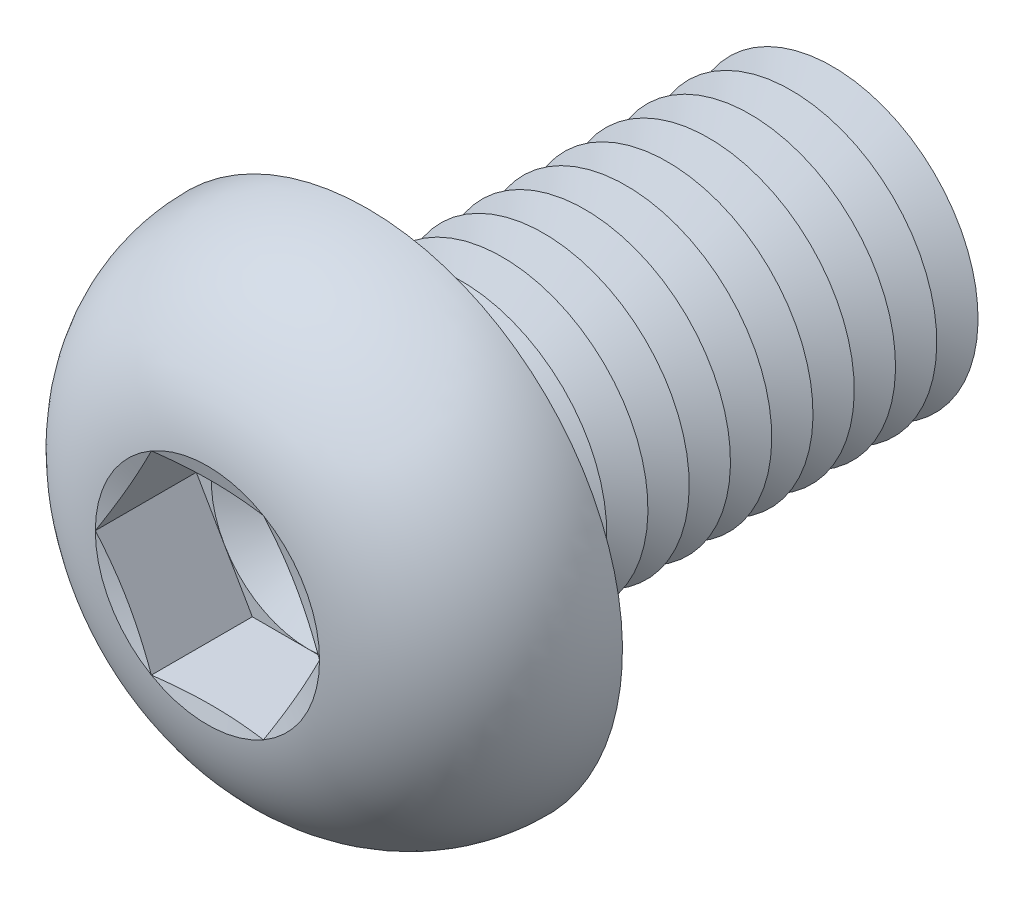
ISO-10303-21;
HEADER;
FILE_DESCRIPTION(('STEP AP214'),'2;1');
FILE_NAME('part.step','',(''),(''),'','','');
FILE_SCHEMA(('AUTOMOTIVE_DESIGN { 1 0 10303 214 1 1 1 1 }'));
ENDSEC;
DATA;
#1=APPLICATION_CONTEXT('core data for automotive mechanical design processes');
#2=APPLICATION_PROTOCOL_DEFINITION('international standard','automotive_design',2000,#1);
#3=PRODUCT_CONTEXT('',#1,'mechanical');
#4=PRODUCT('Part','Part','',(#3));
#5=PRODUCT_RELATED_PRODUCT_CATEGORY('part','',(#4));
#6=PRODUCT_DEFINITION_FORMATION('','',#4);
#7=PRODUCT_DEFINITION_CONTEXT('part definition',#1,'design');
#8=PRODUCT_DEFINITION('design','',#6,#7);
#9=PRODUCT_DEFINITION_SHAPE('','',#8);
#10=(LENGTH_UNIT() NAMED_UNIT(*) SI_UNIT(.MILLI.,.METRE.));
#11=(NAMED_UNIT(*) PLANE_ANGLE_UNIT() SI_UNIT($,.RADIAN.));
#12=(NAMED_UNIT(*) SI_UNIT($,.STERADIAN.) SOLID_ANGLE_UNIT());
#13=UNCERTAINTY_MEASURE_WITH_UNIT(LENGTH_MEASURE(1.E-05),#10,'distance_accuracy_value','');
#14=(GEOMETRIC_REPRESENTATION_CONTEXT(3) GLOBAL_UNCERTAINTY_ASSIGNED_CONTEXT((#13)) GLOBAL_UNIT_ASSIGNED_CONTEXT((#10,
#11,#12)) REPRESENTATION_CONTEXT('',''));
#15=CARTESIAN_POINT('',(0.,0.,0.));
#16=DIRECTION('',(0.,0.,1.));
#17=DIRECTION('',(1.,0.,0.));
#18=AXIS2_PLACEMENT_3D('',#15,#16,#17);
#19=CARTESIAN_POINT('',(0.,0.,2.43999999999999));
#20=DIRECTION('',(0.,0.,1.));
#21=DIRECTION('',(1.,0.,0.));
#22=AXIS2_PLACEMENT_3D('',#19,#20,#21);
#23=PLANE('',#22);
#24=CARTESIAN_POINT('',(0.,0.,2.43999999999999));
#25=DIRECTION('',(0.,0.,1.));
#26=DIRECTION('',(1.,0.,0.));
#27=AXIS2_PLACEMENT_3D('',#24,#25,#26);
#28=CIRCLE('',#27,3.99999813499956);
#29=CARTESIAN_POINT('',(3.4641,1.99999906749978,2.43999999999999));
#30=VERTEX_POINT('',#29);
#31=CARTESIAN_POINT('',(0.,3.99999813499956,2.43999999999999));
#32=VERTEX_POINT('',#31);
#33=EDGE_CURVE('E117',#30,#32,#28,.T.);
#34=ORIENTED_EDGE('',*,*,#33,.F.);
#35=DIRECTION('',(-0.5,0.866025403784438,0.));
#36=VECTOR('',#35,1.);
#37=CARTESIAN_POINT('',(4.6188,0.,2.43999999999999));
#38=LINE('',#37,#36);
#39=CARTESIAN_POINT('',(2.3094,3.99999813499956,2.43999999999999));
#40=VERTEX_POINT('',#39);
#41=EDGE_CURVE('E124',#30,#40,#38,.T.);
#42=ORIENTED_EDGE('',*,*,#41,.T.);
#43=DIRECTION('',(-1.,0.,0.));
#44=VECTOR('',#43,1.);
#45=CARTESIAN_POINT('',(2.3094,3.99999813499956,2.43999999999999));
#46=LINE('',#45,#44);
#47=EDGE_CURVE('E135',#40,#32,#46,.T.);
#48=ORIENTED_EDGE('',*,*,#47,.T.);
#49=EDGE_LOOP('',(#34,#42,#48));
#50=FACE_BOUND('',#49,.T.);
#51=ADVANCED_FACE('F38',(#50),#23,.T.);
#52=CARTESIAN_POINT('',(0.,0.,2.43999999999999));
#53=DIRECTION('',(0.,0.,1.));
#54=DIRECTION('',(1.,0.,0.));
#55=AXIS2_PLACEMENT_3D('',#52,#53,#54);
#56=CIRCLE('',#55,3.99999813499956);
#57=CARTESIAN_POINT('',(-3.4641,1.99999906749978,2.43999999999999));
#58=VERTEX_POINT('',#57);
#59=EDGE_CURVE('E11',#32,#58,#56,.T.);
#60=ORIENTED_EDGE('',*,*,#59,.F.);
#61=CARTESIAN_POINT('',(-2.3094,3.99999813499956,2.43999999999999));
#62=VERTEX_POINT('',#61);
#63=EDGE_CURVE('E130',#32,#62,#46,.T.);
#64=ORIENTED_EDGE('',*,*,#63,.T.);
#65=DIRECTION('',(-0.5,-0.866025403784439,0.));
#66=VECTOR('',#65,1.);
#67=CARTESIAN_POINT('',(-2.3094,3.99999813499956,2.43999999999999));
#68=LINE('',#67,#66);
#69=EDGE_CURVE('E133',#62,#58,#68,.T.);
#70=ORIENTED_EDGE('',*,*,#69,.T.);
#71=EDGE_LOOP('',(#60,#64,#70));
#72=FACE_BOUND('',#71,.T.);
#73=ADVANCED_FACE('F129',(#72),#23,.T.);
#74=CARTESIAN_POINT('',(-3.4641,-1.99999906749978,2.43999999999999));
#75=VERTEX_POINT('',#74);
#76=EDGE_CURVE('E48',#58,#75,#56,.T.);
#77=ORIENTED_EDGE('',*,*,#76,.F.);
#78=CARTESIAN_POINT('',(-4.6188,0.,2.43999999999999));
#79=VERTEX_POINT('',#78);
#80=EDGE_CURVE('E142',#58,#79,#68,.T.);
#81=ORIENTED_EDGE('',*,*,#80,.T.);
#82=DIRECTION('',(0.5,-0.866025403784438,0.));
#83=VECTOR('',#82,1.);
#84=CARTESIAN_POINT('',(-4.6188,0.,2.43999999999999));
#85=LINE('',#84,#83);
#86=EDGE_CURVE('E151',#79,#75,#85,.T.);
#87=ORIENTED_EDGE('',*,*,#86,.T.);
#88=EDGE_LOOP('',(#77,#81,#87));
#89=FACE_BOUND('',#88,.T.);
#90=ADVANCED_FACE('F358',(#89),#23,.T.);
#91=CARTESIAN_POINT('',(0.,-3.99999813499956,2.43999999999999));
#92=VERTEX_POINT('',#91);
#93=EDGE_CURVE('E344',#75,#92,#56,.T.);
#94=ORIENTED_EDGE('',*,*,#93,.F.);
#95=CARTESIAN_POINT('',(-2.3094,-3.99999813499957,2.43999999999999));
#96=VERTEX_POINT('',#95);
#97=EDGE_CURVE('E150',#75,#96,#85,.T.);
#98=ORIENTED_EDGE('',*,*,#97,.T.);
#99=DIRECTION('',(1.,0.,0.));
#100=VECTOR('',#99,1.);
#101=CARTESIAN_POINT('',(-2.3094,-3.99999813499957,2.43999999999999));
#102=LINE('',#101,#100);
#103=EDGE_CURVE('E156',#96,#92,#102,.T.);
#104=ORIENTED_EDGE('',*,*,#103,.T.);
#105=EDGE_LOOP('',(#94,#98,#104));
#106=FACE_BOUND('',#105,.T.);
#107=ADVANCED_FACE('F352',(#106),#23,.T.);
#108=CARTESIAN_POINT('',(3.4641,-1.99999906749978,2.43999999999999));
#109=VERTEX_POINT('',#108);
#110=EDGE_CURVE('E55',#92,#109,#56,.T.);
#111=ORIENTED_EDGE('',*,*,#110,.F.);
#112=CARTESIAN_POINT('',(2.3094,-3.99999813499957,2.43999999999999));
#113=VERTEX_POINT('',#112);
#114=EDGE_CURVE('E155',#92,#113,#102,.T.);
#115=ORIENTED_EDGE('',*,*,#114,.T.);
#116=DIRECTION('',(0.5,0.866025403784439,0.));
#117=VECTOR('',#116,1.);
#118=CARTESIAN_POINT('',(2.3094,-3.99999813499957,2.43999999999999));
#119=LINE('',#118,#117);
#120=EDGE_CURVE('E161',#113,#109,#119,.T.);
#121=ORIENTED_EDGE('',*,*,#120,.T.);
#122=EDGE_LOOP('',(#111,#115,#121));
#123=FACE_BOUND('',#122,.T.);
#124=ADVANCED_FACE('F427',(#123),#23,.T.);
#125=CARTESIAN_POINT('',(0.,0.,6.59999999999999));
#126=DIRECTION('',(0.,0.,1.));
#127=DIRECTION('',(0.,-1.,0.));
#128=AXIS2_PLACEMENT_3D('',#125,#126,#127);
#129=CONICAL_SURFACE('',#128,4.6188,1.30899693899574);
#130=CARTESIAN_POINT('',(4.61891547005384,-0.000200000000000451,6.6000309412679));
#131=CARTESIAN_POINT('',(4.52300232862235,0.16592643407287,6.57431944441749));
#132=CARTESIAN_POINT('',(4.42691527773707,0.332354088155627,6.55097758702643));
#133=CARTESIAN_POINT('',(4.23440181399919,0.665797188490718,6.50996805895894));
#134=CARTESIAN_POINT('',(4.13797527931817,0.832812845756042,6.49230269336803));
#135=CARTESIAN_POINT('',(3.94536752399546,1.16641926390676,6.46367750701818));
#136=CARTESIAN_POINT('',(3.84918760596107,1.33300776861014,6.45268354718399));
#137=CARTESIAN_POINT('',(3.6567051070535,1.66639723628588,6.4379417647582));
#138=CARTESIAN_POINT('',(3.56040255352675,1.83319815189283,6.43419253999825));
#139=CARTESIAN_POINT('',(3.36779744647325,2.16679998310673,6.43419253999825));
#140=CARTESIAN_POINT('',(3.2714948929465,2.33360089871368,6.4379417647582));
#141=CARTESIAN_POINT('',(3.07901239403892,2.66699036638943,6.45268354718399));
#142=CARTESIAN_POINT('',(2.98283247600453,2.8335788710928,6.46367750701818));
#143=CARTESIAN_POINT('',(2.79022472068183,3.16718528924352,6.49230269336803));
#144=CARTESIAN_POINT('',(2.69379818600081,3.33420094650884,6.50996805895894));
#145=CARTESIAN_POINT('',(2.50128472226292,3.66764404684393,6.55097758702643));
#146=CARTESIAN_POINT('',(2.40519767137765,3.83407170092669,6.57431944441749));
#147=CARTESIAN_POINT('',(2.30928452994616,4.00019813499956,6.6000309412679));
#148=B_SPLINE_CURVE_WITH_KNOTS('',3,(#130,#131,#132,#133,#134,#135,#136,#137,#138,#139,#140,
#141,#142,#143,#144,#145,#146,#147),.UNSPECIFIED.,.F.,.F.,(4,2,2,2,2,2,2,2,4),(0.,
0.580655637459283,1.16154676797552,1.73943971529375,2.31722080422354,2.89500189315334,
3.47289484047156,4.05378597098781,4.63444160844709),.UNSPECIFIED.);
#149=CARTESIAN_POINT('',(4.6188,0.,6.59999999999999));
#150=VERTEX_POINT('',#149);
#151=CARTESIAN_POINT('',(2.30940000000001,3.99999813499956,6.6));
#152=VERTEX_POINT('',#151);
#153=EDGE_CURVE('E221',#150,#152,#148,.T.);
#154=ORIENTED_EDGE('',*,*,#153,.F.);
#155=CARTESIAN_POINT('',(0.,0.,6.59999999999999));
#156=DIRECTION('',(0.,0.,-1.));
#157=DIRECTION('',(0.,1.,0.));
#158=AXIS2_PLACEMENT_3D('',#155,#156,#157);
#159=CIRCLE('',#158,4.6188);
#160=EDGE_CURVE('E324',#152,#150,#159,.T.);
#161=ORIENTED_EDGE('',*,*,#160,.F.);
#162=EDGE_LOOP('',(#154,#161));
#163=FACE_BOUND('',#162,.T.);
#164=ADVANCED_FACE('F431',(#163),#129,.F.);
#165=CARTESIAN_POINT('',(2.30928452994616,-4.00019813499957,6.6000309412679));
#166=CARTESIAN_POINT('',(2.40519767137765,-3.8340717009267,6.57431944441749));
#167=CARTESIAN_POINT('',(2.50128472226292,-3.66764404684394,6.55097758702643));
#168=CARTESIAN_POINT('',(2.69379818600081,-3.33420094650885,6.50996805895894));
#169=CARTESIAN_POINT('',(2.79022472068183,-3.16718528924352,6.49230269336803));
#170=CARTESIAN_POINT('',(2.98283247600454,-2.8335788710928,6.46367750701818));
#171=CARTESIAN_POINT('',(3.07901239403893,-2.66699036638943,6.45268354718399));
#172=CARTESIAN_POINT('',(3.2714948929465,-2.33360089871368,6.4379417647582));
#173=CARTESIAN_POINT('',(3.36779744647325,-2.16679998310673,6.43419253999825));
#174=CARTESIAN_POINT('',(3.56040255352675,-1.83319815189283,6.43419253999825));
#175=CARTESIAN_POINT('',(3.6567051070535,-1.66639723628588,6.4379417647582));
#176=CARTESIAN_POINT('',(3.84918760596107,-1.33300776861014,6.45268354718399));
#177=CARTESIAN_POINT('',(3.94536752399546,-1.16641926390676,6.46367750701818));
#178=CARTESIAN_POINT('',(4.13797527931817,-0.832812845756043,6.49230269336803));
#179=CARTESIAN_POINT('',(4.23440181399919,-0.665797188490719,6.50996805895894));
#180=CARTESIAN_POINT('',(4.42691527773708,-0.332354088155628,6.55097758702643));
#181=CARTESIAN_POINT('',(4.52300232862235,-0.16592643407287,6.57431944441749));
#182=CARTESIAN_POINT('',(4.61891547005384,0.000200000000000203,6.6000309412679));
#183=B_SPLINE_CURVE_WITH_KNOTS('',3,(#165,#166,#167,#168,#169,#170,#171,#172,#173,#174,#175,
#176,#177,#178,#179,#180,#181,#182),.UNSPECIFIED.,.F.,.F.,(4,2,2,2,2,2,2,2,4),(0.,
0.580655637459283,1.16154676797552,1.73943971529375,2.31722080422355,2.89500189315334,
3.47289484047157,4.05378597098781,4.63444160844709),.UNSPECIFIED.);
#184=CARTESIAN_POINT('',(2.3094,-3.99999813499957,6.59999999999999));
#185=VERTEX_POINT('',#184);
#186=EDGE_CURVE('E230',#185,#150,#183,.T.);
#187=ORIENTED_EDGE('',*,*,#186,.F.);
#188=EDGE_CURVE('E329',#150,#185,#159,.T.);
#189=ORIENTED_EDGE('',*,*,#188,.F.);
#190=EDGE_LOOP('',(#187,#189));
#191=FACE_BOUND('',#190,.T.);
#192=ADVANCED_FACE('F393',(#191),#129,.F.);
#193=CARTESIAN_POINT('',(-6.96966750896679,-3.99999813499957,7.51561854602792));
#194=CARTESIAN_POINT('',(-6.80094634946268,-3.99999813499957,7.47641178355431));
#195=CARTESIAN_POINT('',(-6.63214895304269,-3.99999813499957,7.43753277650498));
#196=CARTESIAN_POINT('',(-6.29436999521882,-3.99999813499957,7.36057075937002));
#197=CARTESIAN_POINT('',(-6.12538843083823,-3.99999813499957,7.3224877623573));
#198=CARTESIAN_POINT('',(-5.61806276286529,-3.99999813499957,7.20963087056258));
#199=CARTESIAN_POINT('',(-5.27940301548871,-3.99999813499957,7.13626437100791));
#200=CARTESIAN_POINT('',(-4.5977576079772,-3.99999813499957,6.99431141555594));
#201=CARTESIAN_POINT('',(-4.25476115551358,-3.99999813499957,6.92577621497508));
#202=CARTESIAN_POINT('',(-3.56716783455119,-3.99999813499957,6.79696563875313));
#203=CARTESIAN_POINT('',(-3.22257082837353,-3.99999813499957,6.73669098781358));
#204=CARTESIAN_POINT('',(-2.54069952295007,-3.99999813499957,6.63002020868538));
#205=CARTESIAN_POINT('',(-2.20347918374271,-3.99999813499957,6.58329286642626));
#206=CARTESIAN_POINT('',(-1.6962445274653,-3.99999813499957,6.52585827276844));
#207=CARTESIAN_POINT('',(-1.52694760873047,-3.99999813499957,6.50882377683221));
#208=CARTESIAN_POINT('',(-1.187938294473,-3.99999813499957,6.47963274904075));
#209=CARTESIAN_POINT('',(-1.01822592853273,-3.99999813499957,6.4674758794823));
#210=CARTESIAN_POINT('',(-0.679233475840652,-3.99999813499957,6.44863176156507));
#211=CARTESIAN_POINT('',(-0.509954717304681,-3.99999813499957,6.44192096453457));
#212=CARTESIAN_POINT('',(-0.171265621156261,-3.99999813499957,6.43422163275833));
#213=CARTESIAN_POINT('',(-0.00185528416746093,-3.99999813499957,6.43323307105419));
#214=CARTESIAN_POINT('',(0.336912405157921,-3.99999813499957,6.43703123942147));
#215=CARTESIAN_POINT('',(0.506269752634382,-3.99999813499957,6.44181839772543));
#216=CARTESIAN_POINT('',(0.844732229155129,-3.99999813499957,6.45691823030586));
#217=CARTESIAN_POINT('',(1.0138373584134,-3.99999813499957,6.46723089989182));
#218=CARTESIAN_POINT('',(1.42449950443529,-3.99999813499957,6.49843349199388));
#219=CARTESIAN_POINT('',(1.66585565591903,-3.99999813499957,6.52196685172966));
#220=CARTESIAN_POINT('',(2.14755410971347,-3.99999813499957,6.57749710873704));
#221=CARTESIAN_POINT('',(2.3878964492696,-3.99999813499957,6.60949369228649));
#222=CARTESIAN_POINT('',(2.86835569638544,-3.99999813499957,6.68017769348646));
#223=CARTESIAN_POINT('',(3.10846949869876,-3.99999813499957,6.71888590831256));
#224=CARTESIAN_POINT('',(3.5878341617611,-3.99999813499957,6.80132981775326));
#225=CARTESIAN_POINT('',(3.82708497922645,-3.99999813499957,6.84506576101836));
#226=CARTESIAN_POINT('',(4.30977392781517,-3.99999813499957,6.93726543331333));
#227=CARTESIAN_POINT('',(4.55319689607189,-3.99999813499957,6.98580793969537));
#228=CARTESIAN_POINT('',(5.03943022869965,-3.99999813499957,7.08586668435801));
#229=CARTESIAN_POINT('',(5.28224058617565,-3.99999813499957,7.13738295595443));
#230=CARTESIAN_POINT('',(5.76604885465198,-3.99999813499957,7.24238429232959));
#231=CARTESIAN_POINT('',(6.00704943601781,-3.99999813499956,7.29585711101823));
#232=CARTESIAN_POINT('',(6.48863948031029,-3.99999813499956,7.4045482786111));
#233=CARTESIAN_POINT('',(6.72922897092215,-3.99999813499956,7.45976650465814));
#234=CARTESIAN_POINT('',(6.9696675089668,-3.99999813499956,7.51561854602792));
#235=B_SPLINE_CURVE_WITH_KNOTS('',3,(#193,#194,#195,#196,#197,#198,#199,#200,#201,#202,#203,
#204,#205,#206,#207,#208,#209,#210,#211,#212,#213,#214,#215,#216,#217,#218,#219,#220,#221,#222,
#223,#224,#225,#226,#227,#228,#229,#230,#231,#232,#233,#234),.UNSPECIFIED.,.F.,.F.,(4,2,2,2,2,2,
2,2,2,2,2,2,2,2,2,2,2,2,2,2,4),(0.,0.519649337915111,1.03930720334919,2.07882421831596,
3.12808572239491,4.17743921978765,5.19841727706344,5.7088142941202,6.21917596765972,
6.7273189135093,7.23545946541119,7.74363769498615,8.25181549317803,8.9791183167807,
9.70639418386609,10.4359652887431,11.1655724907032,11.910195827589,12.6548275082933,
13.395405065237,14.1359306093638),.UNSPECIFIED.);
#236=CARTESIAN_POINT('',(-2.3094,-3.99999813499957,6.59999999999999));
#237=VERTEX_POINT('',#236);
#238=EDGE_CURVE('E372',#237,#185,#235,.T.);
#239=ORIENTED_EDGE('',*,*,#238,.F.);
#240=EDGE_CURVE('E385',#185,#237,#159,.T.);
#241=ORIENTED_EDGE('',*,*,#240,.F.);
#242=EDGE_LOOP('',(#239,#241));
#243=FACE_BOUND('',#242,.T.);
#244=ADVANCED_FACE('F399',(#243),#129,.F.);
#245=CARTESIAN_POINT('',(-4.61891547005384,0.000199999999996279,6.6000309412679));
#246=CARTESIAN_POINT('',(-4.52300232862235,-0.165926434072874,6.57431944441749));
#247=CARTESIAN_POINT('',(-4.42691527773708,-0.332354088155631,6.55097758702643));
#248=CARTESIAN_POINT('',(-4.23440181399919,-0.665797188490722,6.50996805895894));
#249=CARTESIAN_POINT('',(-4.13797527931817,-0.832812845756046,6.49230269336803));
#250=CARTESIAN_POINT('',(-3.94536752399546,-1.16641926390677,6.46367750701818));
#251=CARTESIAN_POINT('',(-3.84918760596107,-1.33300776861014,6.45268354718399));
#252=CARTESIAN_POINT('',(-3.6567051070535,-1.66639723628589,6.4379417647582));
#253=CARTESIAN_POINT('',(-3.56040255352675,-1.83319815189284,6.43419253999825));
#254=CARTESIAN_POINT('',(-3.36779744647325,-2.16679998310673,6.43419253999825));
#255=CARTESIAN_POINT('',(-3.2714948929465,-2.33360089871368,6.4379417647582));
#256=CARTESIAN_POINT('',(-3.07901239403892,-2.66699036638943,6.45268354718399));
#257=CARTESIAN_POINT('',(-2.98283247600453,-2.8335788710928,6.46367750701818));
#258=CARTESIAN_POINT('',(-2.79022472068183,-3.16718528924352,6.49230269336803));
#259=CARTESIAN_POINT('',(-2.69379818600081,-3.33420094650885,6.50996805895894));
#260=CARTESIAN_POINT('',(-2.50128472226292,-3.66764404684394,6.55097758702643));
#261=CARTESIAN_POINT('',(-2.40519767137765,-3.8340717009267,6.57431944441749));
#262=CARTESIAN_POINT('',(-2.30928452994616,-4.00019813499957,6.6000309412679));
#263=B_SPLINE_CURVE_WITH_KNOTS('',3,(#245,#246,#247,#248,#249,#250,#251,#252,#253,#254,#255,
#256,#257,#258,#259,#260,#261,#262),.UNSPECIFIED.,.F.,.F.,(4,2,2,2,2,2,2,2,4),(0.,
0.580655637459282,1.16154676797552,1.73943971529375,2.31722080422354,2.89500189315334,
3.47289484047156,4.05378597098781,4.63444160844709),.UNSPECIFIED.);
#264=CARTESIAN_POINT('',(-4.6188,0.,6.59999999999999));
#265=VERTEX_POINT('',#264);
#266=EDGE_CURVE('E363',#265,#237,#263,.T.);
#267=ORIENTED_EDGE('',*,*,#266,.F.);
#268=EDGE_CURVE('E369',#237,#265,#159,.T.);
#269=ORIENTED_EDGE('',*,*,#268,.F.);
#270=EDGE_LOOP('',(#267,#269));
#271=FACE_BOUND('',#270,.T.);
#272=ADVANCED_FACE('F367',(#271),#129,.F.);
#273=CARTESIAN_POINT('',(-2.30928452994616,4.00019813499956,6.6000309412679));
#274=CARTESIAN_POINT('',(-2.40519767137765,3.83407170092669,6.57431944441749));
#275=CARTESIAN_POINT('',(-2.50128472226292,3.66764404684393,6.55097758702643));
#276=CARTESIAN_POINT('',(-2.69379818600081,3.33420094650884,6.50996805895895));
#277=CARTESIAN_POINT('',(-2.79022472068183,3.16718528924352,6.49230269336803));
#278=CARTESIAN_POINT('',(-2.98283247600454,2.8335788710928,6.46367750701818));
#279=CARTESIAN_POINT('',(-3.07901239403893,2.66699036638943,6.45268354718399));
#280=CARTESIAN_POINT('',(-3.2714948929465,2.33360089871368,6.4379417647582));
#281=CARTESIAN_POINT('',(-3.36779744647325,2.16679998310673,6.43419253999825));
#282=CARTESIAN_POINT('',(-3.56040255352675,1.83319815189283,6.43419253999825));
#283=CARTESIAN_POINT('',(-3.6567051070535,1.66639723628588,6.4379417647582));
#284=CARTESIAN_POINT('',(-3.84918760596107,1.33300776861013,6.45268354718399));
#285=CARTESIAN_POINT('',(-3.94536752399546,1.16641926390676,6.46367750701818));
#286=CARTESIAN_POINT('',(-4.13797527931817,0.832812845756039,6.49230269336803));
#287=CARTESIAN_POINT('',(-4.23440181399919,0.665797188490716,6.50996805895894));
#288=CARTESIAN_POINT('',(-4.42691527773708,0.332354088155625,6.55097758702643));
#289=CARTESIAN_POINT('',(-4.52300232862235,0.165926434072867,6.57431944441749));
#290=CARTESIAN_POINT('',(-4.61891547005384,-0.000200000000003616,6.6000309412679));
#291=B_SPLINE_CURVE_WITH_KNOTS('',3,(#273,#274,#275,#276,#277,#278,#279,#280,#281,#282,#283,
#284,#285,#286,#287,#288,#289,#290),.UNSPECIFIED.,.F.,.F.,(4,2,2,2,2,2,2,2,4),(0.,
0.580655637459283,1.16154676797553,1.73943971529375,2.31722080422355,2.89500189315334,
3.47289484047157,4.05378597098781,4.63444160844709),.UNSPECIFIED.);
#292=CARTESIAN_POINT('',(-2.3094,3.99999813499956,6.59999999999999));
#293=VERTEX_POINT('',#292);
#294=EDGE_CURVE('E194',#293,#265,#291,.T.);
#295=ORIENTED_EDGE('',*,*,#294,.F.);
#296=EDGE_CURVE('E375',#265,#293,#159,.T.);
#297=ORIENTED_EDGE('',*,*,#296,.F.);
#298=EDGE_LOOP('',(#295,#297));
#299=FACE_BOUND('',#298,.T.);
#300=ADVANCED_FACE('F376',(#299),#129,.F.);
#301=CARTESIAN_POINT('',(0.,0.,-14.05));
#302=DIRECTION('',(0.,0.,1.));
#303=DIRECTION('',(0.,-1.,0.));
#304=AXIS2_PLACEMENT_3D('',#301,#302,#303);
#305=CONICAL_SURFACE('',#304,6.,1.0471975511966);
#306=CARTESIAN_POINT('',(0.,0.,-14.9));
#307=DIRECTION('',(0.,0.,1.));
#308=DIRECTION('',(0.,-1.,0.));
#309=AXIS2_PLACEMENT_3D('',#306,#307,#308);
#310=CIRCLE('',#309,4.52775681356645);
#311=CARTESIAN_POINT('',(0.,-4.52775681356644,-14.9));
#312=VERTEX_POINT('',#311);
#313=EDGE_CURVE('E295',#312,#312,#310,.T.);
#314=ORIENTED_EDGE('',*,*,#313,.T.);
#315=EDGE_LOOP('',(#314));
#316=FACE_BOUND('',#315,.T.);
#317=CARTESIAN_POINT('',(0.,0.,-14.05));
#318=DIRECTION('',(0.,0.,1.));
#319=DIRECTION('',(0.,-1.,0.));
#320=AXIS2_PLACEMENT_3D('',#317,#318,#319);
#321=CIRCLE('',#320,6.);
#322=CARTESIAN_POINT('',(0.,-6.,-14.05));
#323=VERTEX_POINT('',#322);
#324=EDGE_CURVE('E291',#323,#323,#321,.T.);
#325=ORIENTED_EDGE('',*,*,#324,.F.);
#326=EDGE_LOOP('',(#325));
#327=FACE_BOUND('',#326,.T.);
#328=ADVANCED_FACE('F458',(#316,#327),#305,.T.);
#329=CARTESIAN_POINT('',(0.,0.,-14.9));
#330=DIRECTION('',(0.,0.,-1.));
#331=DIRECTION('',(0.,1.,0.));
#332=AXIS2_PLACEMENT_3D('',#329,#330,#331);
#333=CONICAL_SURFACE('',#332,4.52775681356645,1.0471975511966);
#334=CARTESIAN_POINT('',(0.,0.,-15.75));
#335=DIRECTION('',(0.,0.,1.));
#336=DIRECTION('',(0.,-1.,0.));
#337=AXIS2_PLACEMENT_3D('',#334,#335,#336);
#338=CIRCLE('',#337,6.);
#339=CARTESIAN_POINT('',(0.,-6.,-15.75));
#340=VERTEX_POINT('',#339);
#341=EDGE_CURVE('E299',#340,#340,#338,.T.);
#342=ORIENTED_EDGE('',*,*,#341,.T.);
#343=EDGE_LOOP('',(#342));
#344=FACE_BOUND('',#343,.T.);
#345=ORIENTED_EDGE('',*,*,#313,.F.);
#346=EDGE_LOOP('',(#345));
#347=FACE_BOUND('',#346,.T.);
#348=ADVANCED_FACE('F463',(#344,#347),#333,.T.);
#349=CARTESIAN_POINT('',(0.,6.00000000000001,-20.));
#350=DIRECTION('',(0.,0.,-1.));
#351=DIRECTION('',(0.,1.,0.));
#352=AXIS2_PLACEMENT_3D('',#349,#350,#351);
#353=PLANE('',#352);
#354=CARTESIAN_POINT('',(0.,0.,-20.));
#355=DIRECTION('',(0.,0.,1.));
#356=DIRECTION('',(0.,-1.,0.));
#357=AXIS2_PLACEMENT_3D('',#354,#355,#356);
#358=CIRCLE('',#357,4.52775681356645);
#359=CARTESIAN_POINT('',(0.,-4.52775681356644,-20.));
#360=VERTEX_POINT('',#359);
#361=EDGE_CURVE('E319',#360,#360,#358,.T.);
#362=ORIENTED_EDGE('',*,*,#361,.F.);
#363=EDGE_LOOP('',(#362));
#364=FACE_BOUND('',#363,.T.);
#365=ADVANCED_FACE('F638',(#364),#353,.T.);
#366=CARTESIAN_POINT('',(0.,0.,-19.15));
#367=DIRECTION('',(0.,0.,1.));
#368=DIRECTION('',(0.,-1.,0.));
#369=AXIS2_PLACEMENT_3D('',#366,#367,#368);
#370=CONICAL_SURFACE('',#369,6.,1.0471975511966);
#371=ORIENTED_EDGE('',*,*,#361,.T.);
#372=EDGE_LOOP('',(#371));
#373=FACE_BOUND('',#372,.T.);
#374=CARTESIAN_POINT('',(0.,0.,-19.15));
#375=DIRECTION('',(0.,0.,1.));
#376=DIRECTION('',(0.,-1.,0.));
#377=AXIS2_PLACEMENT_3D('',#374,#375,#376);
#378=CIRCLE('',#377,6.);
#379=CARTESIAN_POINT('',(0.,-5.99999999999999,-19.15));
#380=VERTEX_POINT('',#379);
#381=EDGE_CURVE('E315',#380,#380,#378,.T.);
#382=ORIENTED_EDGE('',*,*,#381,.F.);
#383=EDGE_LOOP('',(#382));
#384=FACE_BOUND('',#383,.T.);
#385=ADVANCED_FACE('F631',(#373,#384),#370,.T.);
#386=CARTESIAN_POINT('',(0.,0.,-18.3));
#387=DIRECTION('',(0.,0.,-1.));
#388=DIRECTION('',(0.,1.,0.));
#389=AXIS2_PLACEMENT_3D('',#386,#387,#388);
#390=CONICAL_SURFACE('',#389,4.52775681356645,1.0471975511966);
#391=ORIENTED_EDGE('',*,*,#381,.T.);
#392=EDGE_LOOP('',(#391));
#393=FACE_BOUND('',#392,.T.);
#394=CARTESIAN_POINT('',(0.,0.,-18.3));
#395=DIRECTION('',(0.,0.,1.));
#396=DIRECTION('',(0.,-1.,0.));
#397=AXIS2_PLACEMENT_3D('',#394,#395,#396);
#398=CIRCLE('',#397,4.52775681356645);
#399=CARTESIAN_POINT('',(0.,-4.52775681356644,-18.3));
#400=VERTEX_POINT('',#399);
#401=EDGE_CURVE('E311',#400,#400,#398,.T.);
#402=ORIENTED_EDGE('',*,*,#401,.F.);
#403=EDGE_LOOP('',(#402));
#404=FACE_BOUND('',#403,.T.);
#405=ADVANCED_FACE('F637',(#393,#404),#390,.T.);
#406=CARTESIAN_POINT('',(0.,0.,-17.45));
#407=DIRECTION('',(0.,0.,1.));
#408=DIRECTION('',(0.,-1.,0.));
#409=AXIS2_PLACEMENT_3D('',#406,#407,#408);
#410=CONICAL_SURFACE('',#409,6.,1.0471975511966);
#411=ORIENTED_EDGE('',*,*,#401,.T.);
#412=EDGE_LOOP('',(#411));
#413=FACE_BOUND('',#412,.T.);
#414=CARTESIAN_POINT('',(0.,0.,-17.45));
#415=DIRECTION('',(0.,0.,1.));
#416=DIRECTION('',(0.,-1.,0.));
#417=AXIS2_PLACEMENT_3D('',#414,#415,#416);
#418=CIRCLE('',#417,6.);
#419=CARTESIAN_POINT('',(0.,-6.,-17.45));
#420=VERTEX_POINT('',#419);
#421=EDGE_CURVE('E307',#420,#420,#418,.T.);
#422=ORIENTED_EDGE('',*,*,#421,.F.);
#423=EDGE_LOOP('',(#422));
#424=FACE_BOUND('',#423,.T.);
#425=ADVANCED_FACE('F669',(#413,#424),#410,.T.);
#426=CARTESIAN_POINT('',(0.,0.,-16.6));
#427=DIRECTION('',(0.,0.,-1.));
#428=DIRECTION('',(0.,1.,0.));
#429=AXIS2_PLACEMENT_3D('',#426,#427,#428);
#430=CONICAL_SURFACE('',#429,4.52775681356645,1.0471975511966);
#431=ORIENTED_EDGE('',*,*,#421,.T.);
#432=EDGE_LOOP('',(#431));
#433=FACE_BOUND('',#432,.T.);
#434=CARTESIAN_POINT('',(0.,0.,-16.6));
#435=DIRECTION('',(0.,0.,1.));
#436=DIRECTION('',(0.,-1.,0.));
#437=AXIS2_PLACEMENT_3D('',#434,#435,#436);
#438=CIRCLE('',#437,4.52775681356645);
#439=CARTESIAN_POINT('',(0.,-4.52775681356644,-16.6));
#440=VERTEX_POINT('',#439);
#441=EDGE_CURVE('E303',#440,#440,#438,.T.);
#442=ORIENTED_EDGE('',*,*,#441,.F.);
#443=EDGE_LOOP('',(#442));
#444=FACE_BOUND('',#443,.T.);
#445=ADVANCED_FACE('F679',(#433,#444),#430,.T.);
#446=CARTESIAN_POINT('',(0.,0.,-15.75));
#447=DIRECTION('',(0.,0.,1.));
#448=DIRECTION('',(0.,-1.,0.));
#449=AXIS2_PLACEMENT_3D('',#446,#447,#448);
#450=CONICAL_SURFACE('',#449,6.,1.0471975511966);
#451=ORIENTED_EDGE('',*,*,#441,.T.);
#452=EDGE_LOOP('',(#451));
#453=FACE_BOUND('',#452,.T.);
#454=ORIENTED_EDGE('',*,*,#341,.F.);
#455=EDGE_LOOP('',(#454));
#456=FACE_BOUND('',#455,.T.);
#457=ADVANCED_FACE('F689',(#453,#456),#450,.T.);
#458=CARTESIAN_POINT('',(0.,0.,-12.35));
#459=DIRECTION('',(0.,0.,1.));
#460=DIRECTION('',(0.,-1.,0.));
#461=AXIS2_PLACEMENT_3D('',#458,#459,#460);
#462=CONICAL_SURFACE('',#461,6.,1.0471975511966);
#463=CARTESIAN_POINT('',(0.,0.,-13.2));
#464=DIRECTION('',(0.,0.,1.));
#465=DIRECTION('',(0.,-1.,0.));
#466=AXIS2_PLACEMENT_3D('',#463,#464,#465);
#467=CIRCLE('',#466,4.52775681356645);
#468=CARTESIAN_POINT('',(0.,-4.52775681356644,-13.2));
#469=VERTEX_POINT('',#468);
#470=EDGE_CURVE('E287',#469,#469,#467,.T.);
#471=ORIENTED_EDGE('',*,*,#470,.T.);
#472=EDGE_LOOP('',(#471));
#473=FACE_BOUND('',#472,.T.);
#474=CARTESIAN_POINT('',(0.,0.,-12.35));
#475=DIRECTION('',(0.,0.,1.));
#476=DIRECTION('',(0.,-1.,0.));
#477=AXIS2_PLACEMENT_3D('',#474,#475,#476);
#478=CIRCLE('',#477,6.);
#479=CARTESIAN_POINT('',(0.,-6.,-12.35));
#480=VERTEX_POINT('',#479);
#481=EDGE_CURVE('E283',#480,#480,#478,.T.);
#482=ORIENTED_EDGE('',*,*,#481,.F.);
#483=EDGE_LOOP('',(#482));
#484=FACE_BOUND('',#483,.T.);
#485=ADVANCED_FACE('F699',(#473,#484),#462,.T.);
#486=CARTESIAN_POINT('',(0.,0.,-13.2));
#487=DIRECTION('',(0.,0.,-1.));
#488=DIRECTION('',(0.,1.,0.));
#489=AXIS2_PLACEMENT_3D('',#486,#487,#488);
#490=CONICAL_SURFACE('',#489,4.52775681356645,1.0471975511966);
#491=ORIENTED_EDGE('',*,*,#324,.T.);
#492=EDGE_LOOP('',(#491));
#493=FACE_BOUND('',#492,.T.);
#494=ORIENTED_EDGE('',*,*,#470,.F.);
#495=EDGE_LOOP('',(#494));
#496=FACE_BOUND('',#495,.T.);
#497=ADVANCED_FACE('F709',(#493,#496),#490,.T.);
#498=CARTESIAN_POINT('',(0.,0.,-10.65));
#499=DIRECTION('',(0.,0.,1.));
#500=DIRECTION('',(0.,-1.,0.));
#501=AXIS2_PLACEMENT_3D('',#498,#499,#500);
#502=CONICAL_SURFACE('',#501,6.,1.0471975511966);
#503=CARTESIAN_POINT('',(0.,0.,-11.5));
#504=DIRECTION('',(0.,0.,1.));
#505=DIRECTION('',(0.,-1.,0.));
#506=AXIS2_PLACEMENT_3D('',#503,#504,#505);
#507=CIRCLE('',#506,4.52775681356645);
#508=CARTESIAN_POINT('',(0.,-4.52775681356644,-11.5));
#509=VERTEX_POINT('',#508);
#510=EDGE_CURVE('E279',#509,#509,#507,.T.);
#511=ORIENTED_EDGE('',*,*,#510,.T.);
#512=EDGE_LOOP('',(#511));
#513=FACE_BOUND('',#512,.T.);
#514=CARTESIAN_POINT('',(0.,0.,-10.65));
#515=DIRECTION('',(0.,0.,1.));
#516=DIRECTION('',(0.,-1.,0.));
#517=AXIS2_PLACEMENT_3D('',#514,#515,#516);
#518=CIRCLE('',#517,6.);
#519=CARTESIAN_POINT('',(0.,-6.,-10.65));
#520=VERTEX_POINT('',#519);
#521=EDGE_CURVE('E275',#520,#520,#518,.T.);
#522=ORIENTED_EDGE('',*,*,#521,.F.);
#523=EDGE_LOOP('',(#522));
#524=FACE_BOUND('',#523,.T.);
#525=ADVANCED_FACE('F719',(#513,#524),#502,.T.);
#526=CARTESIAN_POINT('',(0.,0.,-11.5));
#527=DIRECTION('',(0.,0.,-1.));
#528=DIRECTION('',(0.,1.,0.));
#529=AXIS2_PLACEMENT_3D('',#526,#527,#528);
#530=CONICAL_SURFACE('',#529,4.52775681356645,1.0471975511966);
#531=ORIENTED_EDGE('',*,*,#481,.T.);
#532=EDGE_LOOP('',(#531));
#533=FACE_BOUND('',#532,.T.);
#534=ORIENTED_EDGE('',*,*,#510,.F.);
#535=EDGE_LOOP('',(#534));
#536=FACE_BOUND('',#535,.T.);
#537=ADVANCED_FACE('F729',(#533,#536),#530,.T.);
#538=CARTESIAN_POINT('',(0.,0.,-8.95));
#539=DIRECTION('',(0.,0.,1.));
#540=DIRECTION('',(0.,-1.,0.));
#541=AXIS2_PLACEMENT_3D('',#538,#539,#540);
#542=CONICAL_SURFACE('',#541,6.,1.0471975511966);
#543=CARTESIAN_POINT('',(0.,0.,-9.8));
#544=DIRECTION('',(0.,0.,1.));
#545=DIRECTION('',(0.,-1.,0.));
#546=AXIS2_PLACEMENT_3D('',#543,#544,#545);
#547=CIRCLE('',#546,4.52775681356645);
#548=CARTESIAN_POINT('',(0.,-4.52775681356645,-9.8));
#549=VERTEX_POINT('',#548);
#550=EDGE_CURVE('E271',#549,#549,#547,.T.);
#551=ORIENTED_EDGE('',*,*,#550,.T.);
#552=EDGE_LOOP('',(#551));
#553=FACE_BOUND('',#552,.T.);
#554=CARTESIAN_POINT('',(0.,0.,-8.95));
#555=DIRECTION('',(0.,0.,1.));
#556=DIRECTION('',(0.,-1.,0.));
#557=AXIS2_PLACEMENT_3D('',#554,#555,#556);
#558=CIRCLE('',#557,6.);
#559=CARTESIAN_POINT('',(0.,-6.,-8.95));
#560=VERTEX_POINT('',#559);
#561=EDGE_CURVE('E267',#560,#560,#558,.T.);
#562=ORIENTED_EDGE('',*,*,#561,.F.);
#563=EDGE_LOOP('',(#562));
#564=FACE_BOUND('',#563,.T.);
#565=ADVANCED_FACE('F739',(#553,#564),#542,.T.);
#566=CARTESIAN_POINT('',(0.,0.,-9.8));
#567=DIRECTION('',(0.,0.,-1.));
#568=DIRECTION('',(0.,1.,0.));
#569=AXIS2_PLACEMENT_3D('',#566,#567,#568);
#570=CONICAL_SURFACE('',#569,4.52775681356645,1.0471975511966);
#571=ORIENTED_EDGE('',*,*,#521,.T.);
#572=EDGE_LOOP('',(#571));
#573=FACE_BOUND('',#572,.T.);
#574=ORIENTED_EDGE('',*,*,#550,.F.);
#575=EDGE_LOOP('',(#574));
#576=FACE_BOUND('',#575,.T.);
#577=ADVANCED_FACE('F749',(#573,#576),#570,.T.);
#578=CARTESIAN_POINT('',(0.,0.,-7.25));
#579=DIRECTION('',(0.,0.,1.));
#580=DIRECTION('',(0.,-1.,0.));
#581=AXIS2_PLACEMENT_3D('',#578,#579,#580);
#582=CONICAL_SURFACE('',#581,6.,1.0471975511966);
#583=CARTESIAN_POINT('',(0.,0.,-8.1));
#584=DIRECTION('',(0.,0.,1.));
#585=DIRECTION('',(0.,-1.,0.));
#586=AXIS2_PLACEMENT_3D('',#583,#584,#585);
#587=CIRCLE('',#586,4.52775681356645);
#588=CARTESIAN_POINT('',(0.,-4.52775681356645,-8.1));
#589=VERTEX_POINT('',#588);
#590=EDGE_CURVE('E264',#589,#589,#587,.T.);
#591=ORIENTED_EDGE('',*,*,#590,.T.);
#592=EDGE_LOOP('',(#591));
#593=FACE_BOUND('',#592,.T.);
#594=CARTESIAN_POINT('',(0.,0.,-7.25));
#595=DIRECTION('',(0.,0.,1.));
#596=DIRECTION('',(0.,-1.,0.));
#597=AXIS2_PLACEMENT_3D('',#594,#595,#596);
#598=CIRCLE('',#597,6.);
#599=CARTESIAN_POINT('',(0.,-6.,-7.25));
#600=VERTEX_POINT('',#599);
#601=EDGE_CURVE('E260',#600,#600,#598,.T.);
#602=ORIENTED_EDGE('',*,*,#601,.F.);
#603=EDGE_LOOP('',(#602));
#604=FACE_BOUND('',#603,.T.);
#605=ADVANCED_FACE('F759',(#593,#604),#582,.T.);
#606=CARTESIAN_POINT('',(0.,0.,-8.1));
#607=DIRECTION('',(0.,0.,-1.));
#608=DIRECTION('',(0.,1.,0.));
#609=AXIS2_PLACEMENT_3D('',#606,#607,#608);
#610=CONICAL_SURFACE('',#609,4.52775681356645,1.0471975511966);
#611=ORIENTED_EDGE('',*,*,#561,.T.);
#612=EDGE_LOOP('',(#611));
#613=FACE_BOUND('',#612,.T.);
#614=ORIENTED_EDGE('',*,*,#590,.F.);
#615=EDGE_LOOP('',(#614));
#616=FACE_BOUND('',#615,.T.);
#617=ADVANCED_FACE('F769',(#613,#616),#610,.T.);
#618=CARTESIAN_POINT('',(0.,0.,-5.55));
#619=DIRECTION('',(0.,0.,1.));
#620=DIRECTION('',(0.,-1.,0.));
#621=AXIS2_PLACEMENT_3D('',#618,#619,#620);
#622=CONICAL_SURFACE('',#621,6.,1.0471975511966);
#623=CARTESIAN_POINT('',(0.,0.,-6.4));
#624=DIRECTION('',(0.,0.,1.));
#625=DIRECTION('',(0.,-1.,0.));
#626=AXIS2_PLACEMENT_3D('',#623,#624,#625);
#627=CIRCLE('',#626,4.52775681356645);
#628=CARTESIAN_POINT('',(0.,-4.52775681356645,-6.4));
#629=VERTEX_POINT('',#628);
#630=EDGE_CURVE('E256',#629,#629,#627,.T.);
#631=ORIENTED_EDGE('',*,*,#630,.T.);
#632=EDGE_LOOP('',(#631));
#633=FACE_BOUND('',#632,.T.);
#634=CARTESIAN_POINT('',(0.,0.,-5.55));
#635=DIRECTION('',(0.,0.,1.));
#636=DIRECTION('',(0.,-1.,0.));
#637=AXIS2_PLACEMENT_3D('',#634,#635,#636);
#638=CIRCLE('',#637,6.);
#639=CARTESIAN_POINT('',(0.,-6.,-5.55));
#640=VERTEX_POINT('',#639);
#641=EDGE_CURVE('E252',#640,#640,#638,.T.);
#642=ORIENTED_EDGE('',*,*,#641,.F.);
#643=EDGE_LOOP('',(#642));
#644=FACE_BOUND('',#643,.T.);
#645=ADVANCED_FACE('F779',(#633,#644),#622,.T.);
#646=CARTESIAN_POINT('',(0.,0.,-6.4));
#647=DIRECTION('',(0.,0.,-1.));
#648=DIRECTION('',(0.,1.,0.));
#649=AXIS2_PLACEMENT_3D('',#646,#647,#648);
#650=CONICAL_SURFACE('',#649,4.52775681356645,1.0471975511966);
#651=ORIENTED_EDGE('',*,*,#601,.T.);
#652=EDGE_LOOP('',(#651));
#653=FACE_BOUND('',#652,.T.);
#654=ORIENTED_EDGE('',*,*,#630,.F.);
#655=EDGE_LOOP('',(#654));
#656=FACE_BOUND('',#655,.T.);
#657=ADVANCED_FACE('F789',(#653,#656),#650,.T.);
#658=CARTESIAN_POINT('',(0.,0.,-3.85));
#659=DIRECTION('',(0.,0.,1.));
#660=DIRECTION('',(0.,-1.,0.));
#661=AXIS2_PLACEMENT_3D('',#658,#659,#660);
#662=CONICAL_SURFACE('',#661,6.,1.0471975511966);
#663=CARTESIAN_POINT('',(0.,0.,-4.7));
#664=DIRECTION('',(0.,0.,1.));
#665=DIRECTION('',(0.,-1.,0.));
#666=AXIS2_PLACEMENT_3D('',#663,#664,#665);
#667=CIRCLE('',#666,4.52775681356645);
#668=CARTESIAN_POINT('',(0.,-4.52775681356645,-4.7));
#669=VERTEX_POINT('',#668);
#670=EDGE_CURVE('E248',#669,#669,#667,.T.);
#671=ORIENTED_EDGE('',*,*,#670,.T.);
#672=EDGE_LOOP('',(#671));
#673=FACE_BOUND('',#672,.T.);
#674=CARTESIAN_POINT('',(0.,0.,-3.85));
#675=DIRECTION('',(0.,0.,1.));
#676=DIRECTION('',(0.,-1.,0.));
#677=AXIS2_PLACEMENT_3D('',#674,#675,#676);
#678=CIRCLE('',#677,6.);
#679=CARTESIAN_POINT('',(0.,-6.,-3.85));
#680=VERTEX_POINT('',#679);
#681=EDGE_CURVE('E240',#680,#680,#678,.T.);
#682=ORIENTED_EDGE('',*,*,#681,.F.);
#683=EDGE_LOOP('',(#682));
#684=FACE_BOUND('',#683,.T.);
#685=ADVANCED_FACE('F799',(#673,#684),#662,.T.);
#686=CARTESIAN_POINT('',(0.,0.,-4.7));
#687=DIRECTION('',(0.,0.,-1.));
#688=DIRECTION('',(0.,1.,0.));
#689=AXIS2_PLACEMENT_3D('',#686,#687,#688);
#690=CONICAL_SURFACE('',#689,4.52775681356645,1.0471975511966);
#691=ORIENTED_EDGE('',*,*,#641,.T.);
#692=EDGE_LOOP('',(#691));
#693=FACE_BOUND('',#692,.T.);
#694=ORIENTED_EDGE('',*,*,#670,.F.);
#695=EDGE_LOOP('',(#694));
#696=FACE_BOUND('',#695,.T.);
#697=ADVANCED_FACE('F809',(#693,#696),#690,.T.);
#698=CARTESIAN_POINT('',(0.,0.,-2.15));
#699=DIRECTION('',(0.,0.,1.));
#700=DIRECTION('',(0.,-1.,0.));
#701=AXIS2_PLACEMENT_3D('',#698,#699,#700);
#702=CONICAL_SURFACE('',#701,6.,1.0471975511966);
#703=CARTESIAN_POINT('',(0.,0.,-3.));
#704=DIRECTION('',(0.,0.,1.));
#705=DIRECTION('',(0.,-1.,0.));
#706=AXIS2_PLACEMENT_3D('',#703,#704,#705);
#707=CIRCLE('',#706,4.52775681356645);
#708=CARTESIAN_POINT('',(0.,-4.52775681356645,-3.));
#709=VERTEX_POINT('',#708);
#710=EDGE_CURVE('E229',#709,#709,#707,.T.);
#711=ORIENTED_EDGE('',*,*,#710,.T.);
#712=EDGE_LOOP('',(#711));
#713=FACE_BOUND('',#712,.T.);
#714=CARTESIAN_POINT('',(0.,0.,-2.15));
#715=DIRECTION('',(0.,0.,1.));
#716=DIRECTION('',(0.,-1.,0.));
#717=AXIS2_PLACEMENT_3D('',#714,#715,#716);
#718=CIRCLE('',#717,6.);
#719=CARTESIAN_POINT('',(0.,-6.,-2.15));
#720=VERTEX_POINT('',#719);
#721=EDGE_CURVE('E244',#720,#720,#718,.T.);
#722=ORIENTED_EDGE('',*,*,#721,.F.);
#723=EDGE_LOOP('',(#722));
#724=FACE_BOUND('',#723,.T.);
#725=ADVANCED_FACE('F455',(#713,#724),#702,.T.);
#726=CARTESIAN_POINT('',(0.,0.,-3.));
#727=DIRECTION('',(0.,0.,-1.));
#728=DIRECTION('',(0.,1.,0.));
#729=AXIS2_PLACEMENT_3D('',#726,#727,#728);
#730=CONICAL_SURFACE('',#729,4.52775681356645,1.0471975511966);
#731=ORIENTED_EDGE('',*,*,#681,.T.);
#732=EDGE_LOOP('',(#731));
#733=FACE_BOUND('',#732,.T.);
#734=ORIENTED_EDGE('',*,*,#710,.F.);
#735=EDGE_LOOP('',(#734));
#736=FACE_BOUND('',#735,.T.);
#737=ADVANCED_FACE('F218',(#733,#736),#730,.T.);
#738=CARTESIAN_POINT('',(6.9696675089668,3.99999813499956,7.51561854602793));
#739=CARTESIAN_POINT('',(6.80094634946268,3.99999813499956,7.47641178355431));
#740=CARTESIAN_POINT('',(6.63214895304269,3.99999813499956,7.43753277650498));
#741=CARTESIAN_POINT('',(6.29436999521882,3.99999813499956,7.36057075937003));
#742=CARTESIAN_POINT('',(6.12538843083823,3.99999813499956,7.3224877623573));
#743=CARTESIAN_POINT('',(5.61806276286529,3.99999813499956,7.20963087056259));
#744=CARTESIAN_POINT('',(5.27940301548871,3.99999813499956,7.13626437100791));
#745=CARTESIAN_POINT('',(4.5977576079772,3.99999813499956,6.99431141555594));
#746=CARTESIAN_POINT('',(4.25476115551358,3.99999813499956,6.92577621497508));
#747=CARTESIAN_POINT('',(3.56716783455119,3.99999813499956,6.79696563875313));
#748=CARTESIAN_POINT('',(3.22257082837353,3.99999813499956,6.73669098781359));
#749=CARTESIAN_POINT('',(2.54069952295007,3.99999813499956,6.63002020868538));
#750=CARTESIAN_POINT('',(2.20347918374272,3.99999813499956,6.58329286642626));
#751=CARTESIAN_POINT('',(1.69624452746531,3.99999813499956,6.52585827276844));
#752=CARTESIAN_POINT('',(1.52694760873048,3.99999813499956,6.50882377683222));
#753=CARTESIAN_POINT('',(1.18793829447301,3.99999813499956,6.47963274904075));
#754=CARTESIAN_POINT('',(1.01822592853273,3.99999813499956,6.4674758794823));
#755=CARTESIAN_POINT('',(0.679233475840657,3.99999813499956,6.44863176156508));
#756=CARTESIAN_POINT('',(0.509954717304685,3.99999813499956,6.44192096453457));
#757=CARTESIAN_POINT('',(0.171265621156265,3.99999813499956,6.43422163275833));
#758=CARTESIAN_POINT('',(0.00185528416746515,3.99999813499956,6.43323307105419));
#759=CARTESIAN_POINT('',(-0.336912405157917,3.99999813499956,6.43703123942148));
#760=CARTESIAN_POINT('',(-0.506269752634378,3.99999813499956,6.44181839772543));
#761=CARTESIAN_POINT('',(-0.844732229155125,3.99999813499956,6.45691823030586));
#762=CARTESIAN_POINT('',(-1.01383735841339,3.99999813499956,6.46723089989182));
#763=CARTESIAN_POINT('',(-1.42449950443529,3.99999813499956,6.49843349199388));
#764=CARTESIAN_POINT('',(-1.66585565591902,3.99999813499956,6.52196685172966));
#765=CARTESIAN_POINT('',(-2.14755410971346,3.99999813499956,6.57749710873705));
#766=CARTESIAN_POINT('',(-2.38789644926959,3.99999813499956,6.60949369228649));
#767=CARTESIAN_POINT('',(-2.86835569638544,3.99999813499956,6.68017769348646));
#768=CARTESIAN_POINT('',(-3.10846949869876,3.99999813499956,6.71888590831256));
#769=CARTESIAN_POINT('',(-3.58783416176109,3.99999813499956,6.80132981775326));
#770=CARTESIAN_POINT('',(-3.82708497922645,3.99999813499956,6.84506576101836));
#771=CARTESIAN_POINT('',(-4.30977392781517,3.99999813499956,6.93726543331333));
#772=CARTESIAN_POINT('',(-4.55319689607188,3.99999813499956,6.98580793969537));
#773=CARTESIAN_POINT('',(-5.03943022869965,3.99999813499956,7.08586668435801));
#774=CARTESIAN_POINT('',(-5.28224058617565,3.99999813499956,7.13738295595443));
#775=CARTESIAN_POINT('',(-5.76604885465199,3.99999813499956,7.2423842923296));
#776=CARTESIAN_POINT('',(-6.00704943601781,3.99999813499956,7.29585711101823));
#777=CARTESIAN_POINT('',(-6.48863948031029,3.99999813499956,7.4045482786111));
#778=CARTESIAN_POINT('',(-6.72922897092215,3.99999813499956,7.45976650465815));
#779=CARTESIAN_POINT('',(-6.9696675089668,3.99999813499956,7.51561854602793));
#780=B_SPLINE_CURVE_WITH_KNOTS('',3,(#738,#739,#740,#741,#742,#743,#744,#745,#746,#747,#748,
#749,#750,#751,#752,#753,#754,#755,#756,#757,#758,#759,#760,#761,#762,#763,#764,#765,#766,#767,
#768,#769,#770,#771,#772,#773,#774,#775,#776,#777,#778,#779),.UNSPECIFIED.,.F.,.F.,(4,2,2,2,2,2,
2,2,2,2,2,2,2,2,2,2,2,2,2,2,4),(0.,0.519649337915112,1.03930720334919,2.07882421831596,
3.12808572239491,4.17743921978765,5.19841727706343,5.7088142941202,6.21917596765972,
6.7273189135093,7.23545946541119,7.74363769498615,8.25181549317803,8.9791183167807,
9.70639418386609,10.4359652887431,11.1655724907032,11.910195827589,12.6548275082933,
13.395405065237,14.1359306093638),.UNSPECIFIED.);
#781=EDGE_CURVE('E169',#152,#293,#780,.T.);
#782=ORIENTED_EDGE('',*,*,#781,.F.);
#783=EDGE_CURVE('E323',#293,#152,#159,.T.);
#784=ORIENTED_EDGE('',*,*,#783,.F.);
#785=EDGE_LOOP('',(#782,#784));
#786=FACE_BOUND('',#785,.T.);
#787=ADVANCED_FACE('F201',(#786),#129,.F.);
#788=CARTESIAN_POINT('',(0.,0.,0.));
#789=DIRECTION('',(0.,0.,-1.));
#790=DIRECTION('',(0.,1.,0.));
#791=AXIS2_PLACEMENT_3D('',#788,#789,#790);
#792=DEGENERATE_TOROIDAL_SURFACE('',#791,3.85607414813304,6.64392585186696,.T.);
#793=ORIENTED_EDGE('',*,*,#160,.T.);
#794=ORIENTED_EDGE('',*,*,#188,.T.);
#795=ORIENTED_EDGE('',*,*,#240,.T.);
#796=ORIENTED_EDGE('',*,*,#268,.T.);
#797=ORIENTED_EDGE('',*,*,#296,.T.);
#798=ORIENTED_EDGE('',*,*,#783,.T.);
#799=EDGE_LOOP('',(#793,#794,#795,#796,#797,#798));
#800=FACE_BOUND('',#799,.T.);
#801=CARTESIAN_POINT('',(0.,0.,0.));
#802=DIRECTION('',(0.,0.,-1.));
#803=DIRECTION('',(0.,1.,0.));
#804=AXIS2_PLACEMENT_3D('',#801,#802,#803);
#805=CIRCLE('',#804,10.5);
#806=CARTESIAN_POINT('',(0.,10.5,0.));
#807=VERTEX_POINT('',#806);
#808=EDGE_CURVE('E328',#807,#807,#805,.T.);
#809=ORIENTED_EDGE('',*,*,#808,.F.);
#810=EDGE_LOOP('',(#809));
#811=FACE_BOUND('',#810,.T.);
#812=ADVANCED_FACE('F381',(#800,#811),#792,.T.);
#813=CARTESIAN_POINT('',(0.,6.,0.));
#814=DIRECTION('',(0.,0.,-1.));
#815=DIRECTION('',(0.,1.,0.));
#816=AXIS2_PLACEMENT_3D('',#813,#814,#815);
#817=PLANE('',#816);
#818=CARTESIAN_POINT('',(0.,0.,0.));
#819=DIRECTION('',(0.,0.,-1.));
#820=DIRECTION('',(0.,1.,0.));
#821=AXIS2_PLACEMENT_3D('',#818,#819,#820);
#822=CIRCLE('',#821,6.85);
#823=CARTESIAN_POINT('',(0.,6.85,0.));
#824=VERTEX_POINT('',#823);
#825=EDGE_CURVE('E336',#824,#824,#822,.F.);
#826=ORIENTED_EDGE('',*,*,#825,.T.);
#827=EDGE_LOOP('',(#826));
#828=FACE_BOUND('',#827,.T.);
#829=ORIENTED_EDGE('',*,*,#808,.T.);
#830=EDGE_LOOP('',(#829));
#831=FACE_BOUND('',#830,.T.);
#832=ADVANCED_FACE('F454',(#828,#831),#817,.T.);
#833=CARTESIAN_POINT('',(0.,0.,-0.85));
#834=DIRECTION('',(0.,0.,-1.));
#835=DIRECTION('',(0.,1.,0.));
#836=AXIS2_PLACEMENT_3D('',#833,#834,#835);
#837=TOROIDAL_SURFACE('',#836,6.85,0.85);
#838=ORIENTED_EDGE('',*,*,#825,.F.);
#839=EDGE_LOOP('',(#838));
#840=FACE_BOUND('',#839,.T.);
#841=CARTESIAN_POINT('',(0.,0.,-0.849999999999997));
#842=DIRECTION('',(0.,0.,-1.));
#843=DIRECTION('',(0.,1.,0.));
#844=AXIS2_PLACEMENT_3D('',#841,#842,#843);
#845=CIRCLE('',#844,6.);
#846=CARTESIAN_POINT('',(0.,6.,-0.849999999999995));
#847=VERTEX_POINT('',#846);
#848=EDGE_CURVE('E333',#847,#847,#845,.T.);
#849=ORIENTED_EDGE('',*,*,#848,.F.);
#850=EDGE_LOOP('',(#849));
#851=FACE_BOUND('',#850,.T.);
#852=ADVANCED_FACE('F40',(#840,#851),#837,.F.);
#853=CARTESIAN_POINT('',(0.,0.,-20.));
#854=DIRECTION('',(0.,0.,-1.));
#855=DIRECTION('',(0.,1.,0.));
#856=AXIS2_PLACEMENT_3D('',#853,#854,#855);
#857=CYLINDRICAL_SURFACE('',#856,6.);
#858=ORIENTED_EDGE('',*,*,#848,.T.);
#859=EDGE_LOOP('',(#858));
#860=FACE_BOUND('',#859,.T.);
#861=ORIENTED_EDGE('',*,*,#721,.T.);
#862=EDGE_LOOP('',(#861));
#863=FACE_BOUND('',#862,.T.);
#864=ADVANCED_FACE('F216',(#860,#863),#857,.T.);
#865=CARTESIAN_POINT('',(4.6188,0.,2.43999999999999));
#866=DIRECTION('',(0.866025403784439,0.5,0.));
#867=DIRECTION('',(-0.5,0.866025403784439,0.));
#868=AXIS2_PLACEMENT_3D('',#865,#866,#867);
#869=PLANE('',#868);
#870=ORIENTED_EDGE('',*,*,#153,.T.);
#871=DIRECTION('',(0.,0.,1.));
#872=VECTOR('',#871,1.);
#873=CARTESIAN_POINT('',(2.3094,3.99999813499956,2.43999999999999));
#874=LINE('',#873,#872);
#875=EDGE_CURVE('E63',#40,#152,#874,.T.);
#876=ORIENTED_EDGE('',*,*,#875,.F.);
#877=ORIENTED_EDGE('',*,*,#41,.F.);
#878=CARTESIAN_POINT('',(4.6188,0.,2.43999999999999));
#879=VERTEX_POINT('',#878);
#880=EDGE_CURVE('E139',#879,#30,#38,.T.);
#881=ORIENTED_EDGE('',*,*,#880,.F.);
#882=DIRECTION('',(0.,0.,1.));
#883=VECTOR('',#882,1.);
#884=CARTESIAN_POINT('',(4.6188,0.,2.43999999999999));
#885=LINE('',#884,#883);
#886=EDGE_CURVE('E165',#879,#150,#885,.T.);
#887=ORIENTED_EDGE('',*,*,#886,.T.);
#888=EDGE_LOOP('',(#870,#876,#877,#881,#887));
#889=FACE_BOUND('',#888,.T.);
#890=ADVANCED_FACE('F211',(#889),#869,.F.);
#891=CARTESIAN_POINT('',(2.3094,-3.99999813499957,2.43999999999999));
#892=DIRECTION('',(0.866025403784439,-0.5,0.));
#893=DIRECTION('',(0.5,0.866025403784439,0.));
#894=AXIS2_PLACEMENT_3D('',#891,#892,#893);
#895=PLANE('',#894);
#896=ORIENTED_EDGE('',*,*,#186,.T.);
#897=ORIENTED_EDGE('',*,*,#886,.F.);
#898=EDGE_CURVE('E160',#109,#879,#119,.T.);
#899=ORIENTED_EDGE('',*,*,#898,.F.);
#900=ORIENTED_EDGE('',*,*,#120,.F.);
#901=DIRECTION('',(0.,0.,1.));
#902=VECTOR('',#901,1.);
#903=CARTESIAN_POINT('',(2.3094,-3.99999813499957,2.43999999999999));
#904=LINE('',#903,#902);
#905=EDGE_CURVE('E170',#113,#185,#904,.T.);
#906=ORIENTED_EDGE('',*,*,#905,.T.);
#907=EDGE_LOOP('',(#896,#897,#899,#900,#906));
#908=FACE_BOUND('',#907,.T.);
#909=ADVANCED_FACE('F215',(#908),#895,.F.);
#910=CARTESIAN_POINT('',(-2.3094,-3.99999813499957,2.43999999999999));
#911=DIRECTION('',(0.,-1.,0.));
#912=DIRECTION('',(1.,0.,0.));
#913=AXIS2_PLACEMENT_3D('',#910,#911,#912);
#914=PLANE('',#913);
#915=ORIENTED_EDGE('',*,*,#238,.T.);
#916=ORIENTED_EDGE('',*,*,#905,.F.);
#917=ORIENTED_EDGE('',*,*,#114,.F.);
#918=ORIENTED_EDGE('',*,*,#103,.F.);
#919=DIRECTION('',(0.,0.,1.));
#920=VECTOR('',#919,1.);
#921=CARTESIAN_POINT('',(-2.3094,-3.99999813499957,2.43999999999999));
#922=LINE('',#921,#920);
#923=EDGE_CURVE('E174',#96,#237,#922,.T.);
#924=ORIENTED_EDGE('',*,*,#923,.T.);
#925=EDGE_LOOP('',(#915,#916,#917,#918,#924));
#926=FACE_BOUND('',#925,.T.);
#927=ADVANCED_FACE('F411',(#926),#914,.F.);
#928=CARTESIAN_POINT('',(-4.6188,0.,2.43999999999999));
#929=DIRECTION('',(-0.866025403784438,-0.5,0.));
#930=DIRECTION('',(0.5,-0.866025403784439,0.));
#931=AXIS2_PLACEMENT_3D('',#928,#929,#930);
#932=PLANE('',#931);
#933=ORIENTED_EDGE('',*,*,#266,.T.);
#934=ORIENTED_EDGE('',*,*,#923,.F.);
#935=ORIENTED_EDGE('',*,*,#97,.F.);
#936=ORIENTED_EDGE('',*,*,#86,.F.);
#937=DIRECTION('',(0.,0.,1.));
#938=VECTOR('',#937,1.);
#939=CARTESIAN_POINT('',(-4.6188,0.,2.43999999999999));
#940=LINE('',#939,#938);
#941=EDGE_CURVE('E178',#79,#265,#940,.T.);
#942=ORIENTED_EDGE('',*,*,#941,.T.);
#943=EDGE_LOOP('',(#933,#934,#935,#936,#942));
#944=FACE_BOUND('',#943,.T.);
#945=ADVANCED_FACE('F357',(#944),#932,.F.);
#946=CARTESIAN_POINT('',(-2.3094,3.99999813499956,2.43999999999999));
#947=DIRECTION('',(-0.866025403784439,0.5,0.));
#948=DIRECTION('',(-0.5,-0.866025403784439,0.));
#949=AXIS2_PLACEMENT_3D('',#946,#947,#948);
#950=PLANE('',#949);
#951=ORIENTED_EDGE('',*,*,#294,.T.);
#952=ORIENTED_EDGE('',*,*,#941,.F.);
#953=ORIENTED_EDGE('',*,*,#80,.F.);
#954=ORIENTED_EDGE('',*,*,#69,.F.);
#955=DIRECTION('',(0.,0.,1.));
#956=VECTOR('',#955,1.);
#957=CARTESIAN_POINT('',(-2.3094,3.99999813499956,2.43999999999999));
#958=LINE('',#957,#956);
#959=EDGE_CURVE('E137',#62,#293,#958,.T.);
#960=ORIENTED_EDGE('',*,*,#959,.T.);
#961=EDGE_LOOP('',(#951,#952,#953,#954,#960));
#962=FACE_BOUND('',#961,.T.);
#963=ADVANCED_FACE('F208',(#962),#950,.F.);
#964=CARTESIAN_POINT('',(2.3094,3.99999813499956,2.43999999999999));
#965=DIRECTION('',(0.,1.,0.));
#966=DIRECTION('',(0.,0.,1.));
#967=AXIS2_PLACEMENT_3D('',#964,#965,#966);
#968=PLANE('',#967);
#969=ORIENTED_EDGE('',*,*,#781,.T.);
#970=ORIENTED_EDGE('',*,*,#959,.F.);
#971=ORIENTED_EDGE('',*,*,#63,.F.);
#972=ORIENTED_EDGE('',*,*,#47,.F.);
#973=ORIENTED_EDGE('',*,*,#875,.T.);
#974=EDGE_LOOP('',(#969,#970,#971,#972,#973));
#975=FACE_BOUND('',#974,.T.);
#976=ADVANCED_FACE('F134',(#975),#968,.F.);
#977=EDGE_CURVE('E42',#109,#30,#56,.T.);
#978=ORIENTED_EDGE('',*,*,#977,.F.);
#979=ORIENTED_EDGE('',*,*,#898,.T.);
#980=ORIENTED_EDGE('',*,*,#880,.T.);
#981=EDGE_LOOP('',(#978,#979,#980));
#982=FACE_BOUND('',#981,.T.);
#983=ADVANCED_FACE('F114',(#982),#23,.T.);
#984=CARTESIAN_POINT('',(0.,0.,2.43999999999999));
#985=DIRECTION('',(0.,0.,1.));
#986=DIRECTION('',(1.,0.,0.));
#987=AXIS2_PLACEMENT_3D('',#984,#985,#986);
#988=CONICAL_SURFACE('',#987,3.99999813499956,1.0471975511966);
#989=CARTESIAN_POINT('',(0.,0.,0.130600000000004));
#990=VERTEX_POINT('',#989);
#991=VERTEX_LOOP('',#990);
#992=FACE_BOUND('',#991,.T.);
#993=ORIENTED_EDGE('',*,*,#33,.T.);
#994=ORIENTED_EDGE('',*,*,#59,.T.);
#995=ORIENTED_EDGE('',*,*,#76,.T.);
#996=ORIENTED_EDGE('',*,*,#93,.T.);
#997=ORIENTED_EDGE('',*,*,#110,.T.);
#998=ORIENTED_EDGE('',*,*,#977,.T.);
#999=EDGE_LOOP('',(#993,#994,#995,#996,#997,#998));
#1000=FACE_BOUND('',#999,.T.);
#1001=ADVANCED_FACE('F112',(#992,#1000),#988,.F.);
#1002=CLOSED_SHELL('',(#51,#73,#90,#107,#124,#164,#192,#244,#272,#300,#328,#348,#365,#385,#405,
#425,#445,#457,#485,#497,#525,#537,#565,#577,#605,#617,#645,#657,#685,#697,#725,#737,#787,#812,
#832,#852,#864,#890,#909,#927,#945,#963,#976,#983,#1001));
#1003=MANIFOLD_SOLID_BREP('B2',#1002);
#1004=ADVANCED_BREP_SHAPE_REPRESENTATION('',(#18,#1003),#14);
#1005=SHAPE_DEFINITION_REPRESENTATION(#9,#1004);
ENDSEC;
END-ISO-10303-21;
